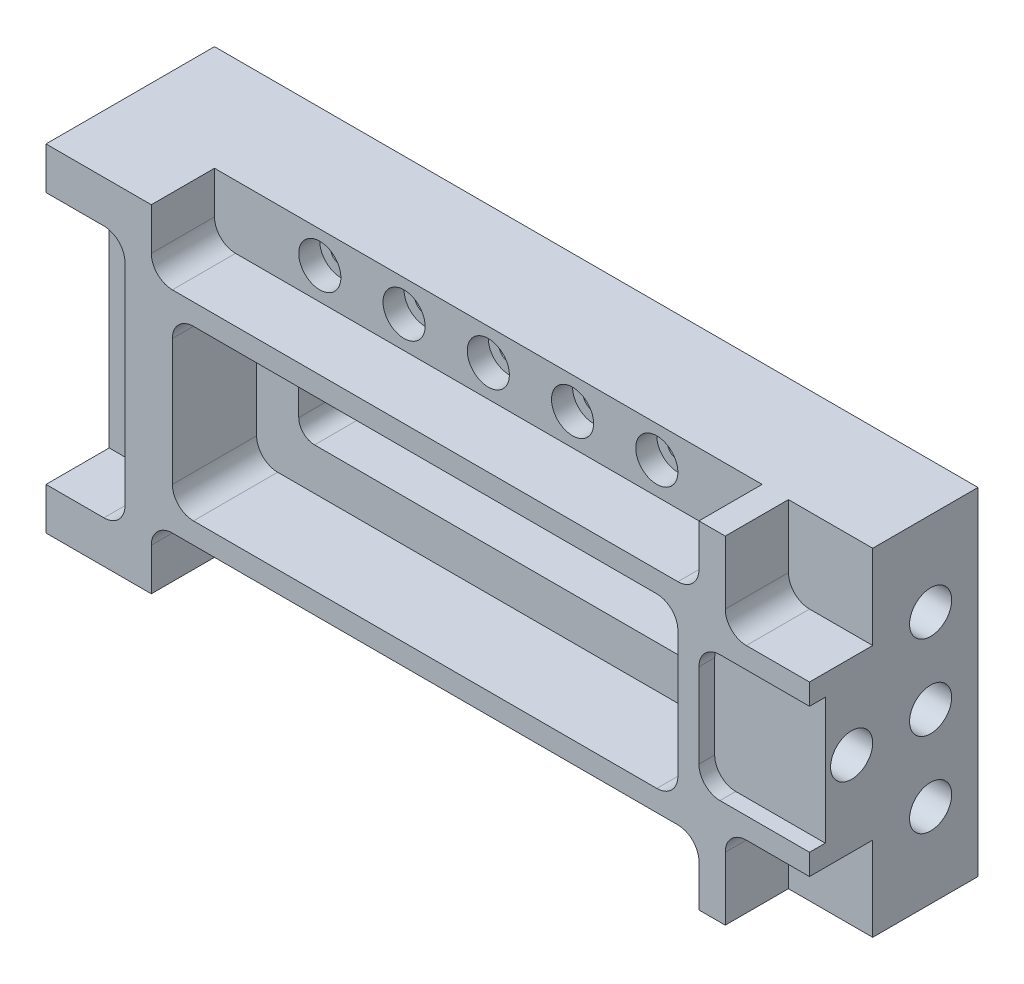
from build123d import *

# Parameters (mm, degrees)
SKETCH1_W           = 230.1875
SKETCH1_H           = 101.6
BASE_EXTRUDE_DEPTH  = 50.8
CUT_EXTRUDE1_DEPTH  = 25.4
CUT_EXTRUDE2_DEPTH  = 19.05
CUT_EXTRUDE3_DEPTH  = 19.05
SKETCH5_R           = 6.35
CUT_EXTRUDE4_DEPTH  = 25.4
CHAMFER2_SIZE       = 1.5748
CUT_EXTRUDE5_START  = -25.4
SKETCH6_R           = 6.35
CUT_EXTRUDE5_DEPTH  = 25.4
CUT_EXTRUDE6_DEPTH  = 19.05
SKETCH8_R           = 3.175
CUT_EXTRUDE7_DEPTH  = 135.113217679
CUT_EXTRUDE8_DEPTH  = 19.05
SKETCH10_R          = 3.175
CUT_EXTRUDE9_DEPTH  = 131.455414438
SKETCH11_R          = 6.35
CUT_EXTRUDE10_DEPTH = 6.35
CUT_EXTRUDE11_DEPTH = 4.7498


with BuildPart() as part:
    # Sketch1 → Base-Extrude (new body)
    with BuildSketch(Plane.XY):
        with Locations((0.79375, 0)):
            Rectangle(SKETCH1_W, SKETCH1_H)
    extrude(amount=BASE_EXTRUDE_DEPTH)

    # Sketch2 → Cut-Extrude1 (cut)
    with BuildSketch(Plane.XY.offset(50.8)):
        with BuildLine():
            Line((-69.85, 25.4), (69.85, 25.4))
            ThreePointArc((69.85, 25.4), (74.340128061, 23.540128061), (76.2, 19.05))
            Line((76.2, 19.05), (76.2, -19.05))
            ThreePointArc((76.2, -19.05), (74.340128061, -23.540128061), (69.85, -25.4))
            Line((69.85, -25.4), (-69.85, -25.4))
            ThreePointArc((-69.85, -25.4), (-74.340128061, -23.540128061), (-76.2, -19.05))
            Line((-76.2, -19.05), (-76.2, 19.05))
            ThreePointArc((-76.2, 19.05), (-74.340128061, 23.540128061), (-69.85, 25.4))
        make_face()
    extrude(amount=-CUT_EXTRUDE1_DEPTH, mode=Mode.SUBTRACT)

    # Sketch3 → Cut-Extrude2 (cut)
    with BuildSketch(Plane.XY.offset(50.8)):
        with BuildLine():
            Line((136.525, 61.9125), (90.4875, 61.9125))
            Line((90.4875, 61.9125), (90.4875, 31.75))
            ThreePointArc((90.4875, 31.75), (92.347371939, 27.259871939), (96.8375, 25.4))
            Line((96.8375, 25.4), (136.525, 25.4))
            Line((136.525, 25.4), (136.525, 61.9125))
        make_face()
        with BuildLine():
            Line((136.525, -57.15), (90.4875, -57.15))
            Line((90.4875, -57.15), (90.4875, -31.75))
            ThreePointArc((90.4875, -31.75), (92.347371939, -27.259871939), (96.8375, -25.4))
            Line((96.8375, -25.4), (136.525, -25.4))
            Line((136.525, -25.4), (136.525, -57.15))
        make_face()
    extrude(amount=-CUT_EXTRUDE2_DEPTH, mode=Mode.SUBTRACT)

    # Sketch4 → Cut-Extrude3 (cut)
    with BuildSketch(Plane.XY.offset(50.8)):
        with BuildLine():
            Line((-120.65, 38.1), (-96.8375, 38.1))
            ThreePointArc((-96.8375, 38.1), (-92.347371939, 36.240128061), (-90.4875, 31.75))
            Line((-90.4875, 31.75), (-90.4875, -31.75))
            ThreePointArc((-90.4875, -31.75), (-92.347371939, -36.240128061), (-96.8375, -38.1))
            Line((-96.8375, -38.1), (-120.65, -38.1))
            Line((-120.65, -38.1), (-120.65, 38.1))
        make_face()
    extrude(amount=-CUT_EXTRUDE3_DEPTH, mode=Mode.SUBTRACT)

    # Sketch5 → Cut-Extrude4 (cut)
    with BuildSketch(Plane.ZY.offset(114.3)):
        with Locations((14.2875, 0)):
            Circle(SKETCH5_R)
        with Locations((14.2875, -25.4)):
            Circle(SKETCH5_R)
        with Locations((14.2875, 25.4)):
            Circle(SKETCH5_R)
    extrude(amount=-CUT_EXTRUDE4_DEPTH, mode=Mode.SUBTRACT)

    # Chamfer2
    chamfer2_edges = [part.edges().sort_by_distance(p)[0] for p in [
        (-114.3, -25.4, 7.9375),
        (-114.3, 0, 7.9375),
        (-114.3, 25.4, 7.9375),
    ]]
    chamfer(chamfer2_edges, length=CHAMFER2_SIZE)

    # Sketch6 → Cut-Extrude5 (cut)
    with BuildSketch(Plane(origin=(115.8875, 0, 0), x_dir=(0, 0, -1), z_dir=(1, 0, 0)).offset(CUT_EXTRUDE5_START)):
        with Locations((-38.1, 0)):
            Circle(SKETCH6_R)
        with Locations(Location((-14.2875, 0, 0), (0, 0, 180))):
            Circle(SKETCH6_R)
        with Locations(Location((-14.2875, 25.4, 0), (0, 0, 180))):
            Circle(SKETCH6_R)
        with Locations(Location((-14.2875, -25.4, 0), (0, 0, 180))):
            Circle(SKETCH6_R)
    extrude(amount=CUT_EXTRUDE5_DEPTH, mode=Mode.SUBTRACT)

    # Sketch7 → Cut-Extrude6 (cut)
    with BuildSketch(Plane.XY.offset(25.4)):
        with BuildLine():
            Line((-58.7375, 12.7), (58.7375, 12.7))
            ThreePointArc((58.7375, 12.7), (62.105096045, 11.305096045), (63.5, 7.9375))
            Line((63.5, 7.9375), (63.5, -7.9375))
            ThreePointArc((63.5, -7.9375), (62.105096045, -11.305096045), (58.7375, -12.7))
            Line((58.7375, -12.7), (-58.7375, -12.7))
            ThreePointArc((-58.7375, -12.7), (-62.105096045, -11.305096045), (-63.5, -7.9375))
            Line((-63.5, -7.9375), (-63.5, 7.9375))
            ThreePointArc((-63.5, 7.9375), (-62.105096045, 11.305096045), (-58.7375, 12.7))
        make_face()
    extrude(amount=-CUT_EXTRUDE6_DEPTH, mode=Mode.SUBTRACT)

    # Sketch8 → Cut-Extrude7 (cut, through all)
    with BuildSketch(Plane.XY.offset(6.35)):
        with Locations((-50.8, 6.35)):
            Circle(SKETCH8_R)
        with Locations((-38.1, 6.35)):
            Circle(SKETCH8_R)
        with Locations((-25.4, 6.35)):
            Circle(SKETCH8_R)
        with Locations((-12.7, 6.35)):
            Circle(SKETCH8_R)
        with Locations((0, 6.35)):
            Circle(SKETCH8_R)
        with Locations((12.7, 6.35)):
            Circle(SKETCH8_R)
        with Locations((25.4, 6.35)):
            Circle(SKETCH8_R)
        with Locations((38.1, 6.35)):
            Circle(SKETCH8_R)
        with Locations((50.8, 6.35)):
            Circle(SKETCH8_R)
        with Locations((-50.8, -6.35)):
            Circle(SKETCH8_R)
        with Locations((-38.1, -6.35)):
            Circle(SKETCH8_R)
        with Locations((-25.4, -6.35)):
            Circle(SKETCH8_R)
        with Locations((-12.7, -6.35)):
            Circle(SKETCH8_R)
        with Locations((0, -6.35)):
            Circle(SKETCH8_R)
        with Locations((12.7, -6.35)):
            Circle(SKETCH8_R)
        with Locations((25.4, -6.35)):
            Circle(SKETCH8_R)
        with Locations((38.1, -6.35)):
            Circle(SKETCH8_R)
        with Locations((50.8, -6.35)):
            Circle(SKETCH8_R)
    extrude(amount=-CUT_EXTRUDE7_DEPTH, mode=Mode.SUBTRACT)

    # Sketch9 → Cut-Extrude8 (cut)
    with BuildSketch(Plane.XY.offset(50.8)):
        with BuildLine():
            Line((-82.55, 63.5), (82.55, 63.5))
            Line((82.55, 63.5), (82.55, 38.1))
            ThreePointArc((82.55, 38.1), (80.690128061, 33.609871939), (76.2, 31.75))
            Line((76.2, 31.75), (-76.2, 31.75))
            ThreePointArc((-76.2, 31.75), (-80.690128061, 33.609871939), (-82.55, 38.1))
            Line((-82.55, 38.1), (-82.55, 63.5))
        make_face()
        with BuildLine():
            Line((-82.55, -60.325), (82.55, -60.325))
            Line((82.55, -60.325), (82.55, -38.1))
            ThreePointArc((82.55, -38.1), (80.690128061, -33.609871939), (76.2, -31.75))
            Line((76.2, -31.75), (-76.2, -31.75))
            ThreePointArc((-76.2, -31.75), (-80.690128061, -33.609871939), (-82.55, -38.1))
            Line((-82.55, -38.1), (-82.55, -60.325))
        make_face()
    extrude(amount=-CUT_EXTRUDE8_DEPTH, mode=Mode.SUBTRACT)

    # Sketch10 → Cut-Extrude9 (cut, through all)
    with BuildSketch(Plane.XY.offset(31.75)):
        with Locations((0, -41.275)):
            Circle(SKETCH10_R)
        with Locations((25.4, -41.275)):
            Circle(SKETCH10_R)
        with Locations((50.8, -41.275)):
            Circle(SKETCH10_R)
        with Locations((-25.4, -41.275)):
            Circle(SKETCH10_R)
        with Locations((-50.8, -41.275)):
            Circle(SKETCH10_R)
        with Locations((0, 41.275)):
            Circle(SKETCH10_R)
        with Locations((25.4, 41.275)):
            Circle(SKETCH10_R)
        with Locations((50.8, 41.275)):
            Circle(SKETCH10_R)
        with Locations((-25.4, 41.275)):
            Circle(SKETCH10_R)
        with Locations((-50.8, 41.275)):
            Circle(SKETCH10_R)
    extrude(amount=-CUT_EXTRUDE9_DEPTH, mode=Mode.SUBTRACT)

    # Sketch11 → Cut-Extrude10 (cut)
    with BuildSketch(Plane.XY.offset(31.75)):
        with Locations((-50.8, 41.275)):
            Circle(SKETCH11_R)
        with Locations((-25.4, 41.275)):
            Circle(SKETCH11_R)
        with Locations((0, 41.275)):
            Circle(SKETCH11_R)
        with Locations((25.4, 41.275)):
            Circle(SKETCH11_R)
        with Locations((50.8, 41.275)):
            Circle(SKETCH11_R)
        with Locations((-50.8, -41.275)):
            Circle(SKETCH11_R)
        with Locations((-25.4, -41.275)):
            Circle(SKETCH11_R)
        with Locations((0, -41.275)):
            Circle(SKETCH11_R)
        with Locations((25.4, -41.275)):
            Circle(SKETCH11_R)
        with Locations((50.8, -41.275)):
            Circle(SKETCH11_R)
    extrude(amount=-CUT_EXTRUDE10_DEPTH, mode=Mode.SUBTRACT)

    # Sketch12 → Cut-Extrude11 (cut)
    with BuildSketch(Plane.XY.offset(50.8)):
        with BuildLine():
            Line((88.9, 19.05), (123.825, 19.05))
            Line((123.825, 19.05), (123.825, -19.05))
            Line((123.825, -19.05), (88.9, -19.05))
            ThreePointArc((88.9, -19.05), (84.409871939, -17.190128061), (82.55, -12.7))
            Line((82.55, -12.7), (82.55, 12.7))
            ThreePointArc((82.55, 12.7), (84.409871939, 17.190128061), (88.9, 19.05))
        make_face()
    extrude(amount=-CUT_EXTRUDE11_DEPTH, mode=Mode.SUBTRACT)


solid = part.part
